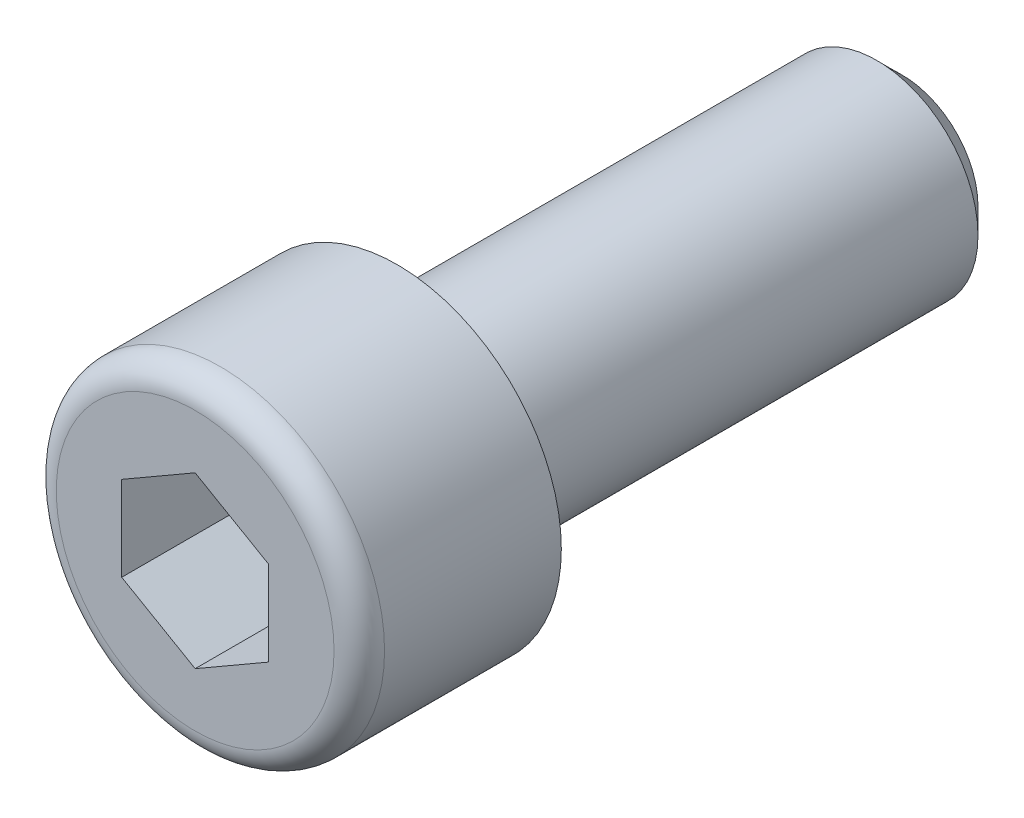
ISO-10303-21;
HEADER;
FILE_DESCRIPTION(('STEP AP214'),'2;1');
FILE_NAME('part.step','',(''),(''),'','','');
FILE_SCHEMA(('AUTOMOTIVE_DESIGN { 1 0 10303 214 1 1 1 1 }'));
ENDSEC;
DATA;
#1=APPLICATION_CONTEXT('core data for automotive mechanical design processes');
#2=APPLICATION_PROTOCOL_DEFINITION('international standard','automotive_design',2000,#1);
#3=PRODUCT_CONTEXT('',#1,'mechanical');
#4=PRODUCT('Part','Part','',(#3));
#5=PRODUCT_RELATED_PRODUCT_CATEGORY('part','',(#4));
#6=PRODUCT_DEFINITION_FORMATION('','',#4);
#7=PRODUCT_DEFINITION_CONTEXT('part definition',#1,'design');
#8=PRODUCT_DEFINITION('design','',#6,#7);
#9=PRODUCT_DEFINITION_SHAPE('','',#8);
#10=(LENGTH_UNIT() NAMED_UNIT(*) SI_UNIT(.MILLI.,.METRE.));
#11=(NAMED_UNIT(*) PLANE_ANGLE_UNIT() SI_UNIT($,.RADIAN.));
#12=(NAMED_UNIT(*) SI_UNIT($,.STERADIAN.) SOLID_ANGLE_UNIT());
#13=UNCERTAINTY_MEASURE_WITH_UNIT(LENGTH_MEASURE(1.E-05),#10,'distance_accuracy_value','');
#14=(GEOMETRIC_REPRESENTATION_CONTEXT(3) GLOBAL_UNCERTAINTY_ASSIGNED_CONTEXT((#13)) GLOBAL_UNIT_ASSIGNED_CONTEXT((#10,
#11,#12)) REPRESENTATION_CONTEXT('',''));
#15=CARTESIAN_POINT('',(0.,0.,0.));
#16=DIRECTION('',(0.,0.,1.));
#17=DIRECTION('',(1.,0.,0.));
#18=AXIS2_PLACEMENT_3D('',#15,#16,#17);
#19=CARTESIAN_POINT('',(-326.297546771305,9.99999999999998,-20.));
#20=DIRECTION('',(0.,0.,1.));
#21=DIRECTION('',(1.,0.,0.));
#22=AXIS2_PLACEMENT_3D('',#19,#20,#21);
#23=CYLINDRICAL_SURFACE('',#22,3.99999999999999);
#24=CARTESIAN_POINT('',(-326.297546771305,9.99999999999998,-19.));
#25=DIRECTION('',(0.,0.,1.));
#26=DIRECTION('',(1.,0.,0.));
#27=AXIS2_PLACEMENT_3D('',#24,#25,#26);
#28=CIRCLE('',#27,3.99999999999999);
#29=CARTESIAN_POINT('',(-322.297546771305,9.99999999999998,-19.));
#30=VERTEX_POINT('',#29);
#31=EDGE_CURVE('E42',#30,#30,#28,.T.);
#32=ORIENTED_EDGE('',*,*,#31,.T.);
#33=EDGE_LOOP('',(#32));
#34=FACE_BOUND('',#33,.T.);
#35=CARTESIAN_POINT('',(-326.297546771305,9.99999999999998,0.));
#36=DIRECTION('',(0.,0.,1.));
#37=DIRECTION('',(1.,0.,0.));
#38=AXIS2_PLACEMENT_3D('',#35,#36,#37);
#39=CIRCLE('',#38,3.99999999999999);
#40=CARTESIAN_POINT('',(-322.297546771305,9.99999999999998,0.));
#41=VERTEX_POINT('',#40);
#42=EDGE_CURVE('E144',#41,#41,#39,.T.);
#43=ORIENTED_EDGE('',*,*,#42,.F.);
#44=EDGE_LOOP('',(#43));
#45=FACE_BOUND('',#44,.T.);
#46=ADVANCED_FACE('F34',(#34,#45),#23,.T.);
#47=CARTESIAN_POINT('',(-326.297546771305,9.99999999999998,-20.));
#48=DIRECTION('',(0.,0.,1.));
#49=DIRECTION('',(1.,0.,0.));
#50=AXIS2_PLACEMENT_3D('',#47,#48,#49);
#51=PLANE('',#50);
#52=CARTESIAN_POINT('',(-326.297546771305,9.99999999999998,-20.));
#53=DIRECTION('',(0.,0.,1.));
#54=DIRECTION('',(1.,0.,0.));
#55=AXIS2_PLACEMENT_3D('',#52,#53,#54);
#56=CIRCLE('',#55,3.);
#57=CARTESIAN_POINT('',(-323.297546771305,9.99999999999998,-20.));
#58=VERTEX_POINT('',#57);
#59=EDGE_CURVE('E11',#58,#58,#56,.F.);
#60=ORIENTED_EDGE('',*,*,#59,.T.);
#61=EDGE_LOOP('',(#60));
#62=FACE_BOUND('',#61,.T.);
#63=ADVANCED_FACE('F171',(#62),#51,.F.);
#64=CARTESIAN_POINT('',(-326.297546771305,9.99999999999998,8.));
#65=DIRECTION('',(0.,0.,-1.));
#66=DIRECTION('',(-1.,0.,0.));
#67=AXIS2_PLACEMENT_3D('',#64,#65,#66);
#68=CYLINDRICAL_SURFACE('',#67,6.50000000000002);
#69=CARTESIAN_POINT('',(-326.297546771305,9.99999999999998,7.));
#70=DIRECTION('',(0.,0.,1.));
#71=DIRECTION('',(1.,0.,0.));
#72=AXIS2_PLACEMENT_3D('',#69,#70,#71);
#73=CIRCLE('',#72,6.50000000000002);
#74=CARTESIAN_POINT('',(-319.797546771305,9.99999999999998,7.));
#75=VERTEX_POINT('',#74);
#76=EDGE_CURVE('E150',#75,#75,#73,.F.);
#77=ORIENTED_EDGE('',*,*,#76,.T.);
#78=EDGE_LOOP('',(#77));
#79=FACE_BOUND('',#78,.T.);
#80=CARTESIAN_POINT('',(-326.297546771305,9.99999999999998,0.));
#81=DIRECTION('',(0.,0.,1.));
#82=DIRECTION('',(1.,0.,0.));
#83=AXIS2_PLACEMENT_3D('',#80,#81,#82);
#84=CIRCLE('',#83,6.50000000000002);
#85=CARTESIAN_POINT('',(-319.797546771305,9.99999999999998,0.));
#86=VERTEX_POINT('',#85);
#87=EDGE_CURVE('E136',#86,#86,#84,.T.);
#88=ORIENTED_EDGE('',*,*,#87,.T.);
#89=EDGE_LOOP('',(#88));
#90=FACE_BOUND('',#89,.T.);
#91=ADVANCED_FACE('F176',(#79,#90),#68,.T.);
#92=CARTESIAN_POINT('',(-326.297546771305,9.99999999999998,8.));
#93=DIRECTION('',(0.,0.,1.));
#94=DIRECTION('',(1.,0.,0.));
#95=AXIS2_PLACEMENT_3D('',#92,#93,#94);
#96=PLANE('',#95);
#97=DIRECTION('',(-0.866025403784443,0.499999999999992,0.));
#98=VECTOR('',#97,1.);
#99=CARTESIAN_POINT('',(-323.389295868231,11.6790794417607,8.));
#100=LINE('',#99,#98);
#101=CARTESIAN_POINT('',(-323.389295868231,11.6790794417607,8.));
#102=VERTEX_POINT('',#101);
#103=CARTESIAN_POINT('',(-326.297546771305,13.3581588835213,8.));
#104=VERTEX_POINT('',#103);
#105=EDGE_CURVE('E49',#102,#104,#100,.T.);
#106=ORIENTED_EDGE('',*,*,#105,.F.);
#107=DIRECTION('',(0.,1.,0.));
#108=VECTOR('',#107,1.);
#109=CARTESIAN_POINT('',(-323.389295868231,8.32092055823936,8.));
#110=LINE('',#109,#108);
#111=CARTESIAN_POINT('',(-323.389295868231,8.32092055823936,8.));
#112=VERTEX_POINT('',#111);
#113=EDGE_CURVE('E132',#112,#102,#110,.T.);
#114=ORIENTED_EDGE('',*,*,#113,.F.);
#115=DIRECTION('',(0.866025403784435,0.500000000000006,0.));
#116=VECTOR('',#115,1.);
#117=CARTESIAN_POINT('',(-326.297546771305,6.64184111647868,8.));
#118=LINE('',#117,#116);
#119=CARTESIAN_POINT('',(-326.297546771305,6.64184111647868,8.));
#120=VERTEX_POINT('',#119);
#121=EDGE_CURVE('E130',#120,#112,#118,.T.);
#122=ORIENTED_EDGE('',*,*,#121,.F.);
#123=DIRECTION('',(0.86602540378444,-0.499999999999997,0.));
#124=VECTOR('',#123,1.);
#125=CARTESIAN_POINT('',(-329.205797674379,8.32092055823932,8.));
#126=LINE('',#125,#124);
#127=CARTESIAN_POINT('',(-329.205797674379,8.32092055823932,8.));
#128=VERTEX_POINT('',#127);
#129=EDGE_CURVE('E97',#128,#120,#126,.T.);
#130=ORIENTED_EDGE('',*,*,#129,.F.);
#131=DIRECTION('',(0.,-1.,0.));
#132=VECTOR('',#131,1.);
#133=CARTESIAN_POINT('',(-329.205797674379,11.6790794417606,8.));
#134=LINE('',#133,#132);
#135=CARTESIAN_POINT('',(-329.205797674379,11.6790794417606,8.));
#136=VERTEX_POINT('',#135);
#137=EDGE_CURVE('E126',#136,#128,#134,.T.);
#138=ORIENTED_EDGE('',*,*,#137,.F.);
#139=DIRECTION('',(-0.866025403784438,-0.500000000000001,0.));
#140=VECTOR('',#139,1.);
#141=CARTESIAN_POINT('',(-326.297546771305,13.3581588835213,8.));
#142=LINE('',#141,#140);
#143=EDGE_CURVE('E123',#104,#136,#142,.T.);
#144=ORIENTED_EDGE('',*,*,#143,.F.);
#145=EDGE_LOOP('',(#106,#114,#122,#130,#138,#144));
#146=FACE_BOUND('',#145,.T.);
#147=CARTESIAN_POINT('',(-326.297546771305,9.99999999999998,8.));
#148=DIRECTION('',(0.,0.,1.));
#149=DIRECTION('',(1.,0.,0.));
#150=AXIS2_PLACEMENT_3D('',#147,#148,#149);
#151=CIRCLE('',#150,5.50000000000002);
#152=CARTESIAN_POINT('',(-320.797546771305,9.99999999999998,8.));
#153=VERTEX_POINT('',#152);
#154=EDGE_CURVE('E147',#153,#153,#151,.T.);
#155=ORIENTED_EDGE('',*,*,#154,.T.);
#156=EDGE_LOOP('',(#155));
#157=FACE_BOUND('',#156,.T.);
#158=ADVANCED_FACE('F182',(#146,#157),#96,.T.);
#159=CARTESIAN_POINT('',(-326.297546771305,9.99999999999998,0.));
#160=DIRECTION('',(0.,0.,1.));
#161=DIRECTION('',(1.,0.,0.));
#162=AXIS2_PLACEMENT_3D('',#159,#160,#161);
#163=PLANE('',#162);
#164=ORIENTED_EDGE('',*,*,#42,.T.);
#165=EDGE_LOOP('',(#164));
#166=FACE_BOUND('',#165,.T.);
#167=ORIENTED_EDGE('',*,*,#87,.F.);
#168=EDGE_LOOP('',(#167));
#169=FACE_BOUND('',#168,.T.);
#170=ADVANCED_FACE('F167',(#166,#169),#163,.F.);
#171=CARTESIAN_POINT('',(-326.297546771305,9.99999999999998,7.));
#172=DIRECTION('',(0.,0.,1.));
#173=DIRECTION('',(1.,0.,0.));
#174=AXIS2_PLACEMENT_3D('',#171,#172,#173);
#175=TOROIDAL_SURFACE('',#174,5.50000000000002,1.);
#176=ORIENTED_EDGE('',*,*,#76,.F.);
#177=EDGE_LOOP('',(#176));
#178=FACE_BOUND('',#177,.T.);
#179=ORIENTED_EDGE('',*,*,#154,.F.);
#180=EDGE_LOOP('',(#179));
#181=FACE_BOUND('',#180,.T.);
#182=ADVANCED_FACE('F159',(#178,#181),#175,.T.);
#183=CARTESIAN_POINT('',(-326.297546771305,9.99999999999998,-19.));
#184=DIRECTION('',(0.,0.,1.));
#185=DIRECTION('',(1.,0.,0.));
#186=AXIS2_PLACEMENT_3D('',#183,#184,#185);
#187=CONICAL_SURFACE('',#186,3.99999999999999,0.785398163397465);
#188=ORIENTED_EDGE('',*,*,#59,.F.);
#189=EDGE_LOOP('',(#188));
#190=FACE_BOUND('',#189,.T.);
#191=ORIENTED_EDGE('',*,*,#31,.F.);
#192=EDGE_LOOP('',(#191));
#193=FACE_BOUND('',#192,.T.);
#194=ADVANCED_FACE('F36',(#190,#193),#187,.T.);
#195=CARTESIAN_POINT('',(-323.389295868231,11.6790794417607,3.));
#196=DIRECTION('',(0.499999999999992,0.866025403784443,0.));
#197=DIRECTION('',(-0.866025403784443,0.499999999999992,0.));
#198=AXIS2_PLACEMENT_3D('',#195,#196,#197);
#199=PLANE('',#198);
#200=ORIENTED_EDGE('',*,*,#105,.T.);
#201=DIRECTION('',(0.,0.,1.));
#202=VECTOR('',#201,1.);
#203=CARTESIAN_POINT('',(-326.297546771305,13.3581588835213,3.));
#204=LINE('',#203,#202);
#205=CARTESIAN_POINT('',(-326.297546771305,13.3581588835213,3.));
#206=VERTEX_POINT('',#205);
#207=EDGE_CURVE('E79',#206,#104,#204,.T.);
#208=ORIENTED_EDGE('',*,*,#207,.F.);
#209=DIRECTION('',(-0.866025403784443,0.499999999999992,0.));
#210=VECTOR('',#209,1.);
#211=CARTESIAN_POINT('',(-323.389295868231,11.6790794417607,3.));
#212=LINE('',#211,#210);
#213=CARTESIAN_POINT('',(-323.389295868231,11.6790794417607,3.));
#214=VERTEX_POINT('',#213);
#215=EDGE_CURVE('E134',#214,#206,#212,.T.);
#216=ORIENTED_EDGE('',*,*,#215,.F.);
#217=DIRECTION('',(0.,0.,1.));
#218=VECTOR('',#217,1.);
#219=CARTESIAN_POINT('',(-323.389295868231,11.6790794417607,3.));
#220=LINE('',#219,#218);
#221=EDGE_CURVE('E57',#214,#102,#220,.T.);
#222=ORIENTED_EDGE('',*,*,#221,.T.);
#223=EDGE_LOOP('',(#200,#208,#216,#222));
#224=FACE_BOUND('',#223,.T.);
#225=ADVANCED_FACE('F158',(#224),#199,.F.);
#226=CARTESIAN_POINT('',(-323.389295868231,8.32092055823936,3.));
#227=DIRECTION('',(1.,0.,0.));
#228=DIRECTION('',(0.,0.,-1.));
#229=AXIS2_PLACEMENT_3D('',#226,#227,#228);
#230=PLANE('',#229);
#231=ORIENTED_EDGE('',*,*,#113,.T.);
#232=ORIENTED_EDGE('',*,*,#221,.F.);
#233=DIRECTION('',(0.,1.,0.));
#234=VECTOR('',#233,1.);
#235=CARTESIAN_POINT('',(-323.389295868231,8.32092055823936,3.));
#236=LINE('',#235,#234);
#237=CARTESIAN_POINT('',(-323.389295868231,8.32092055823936,3.));
#238=VERTEX_POINT('',#237);
#239=EDGE_CURVE('E109',#238,#214,#236,.T.);
#240=ORIENTED_EDGE('',*,*,#239,.F.);
#241=DIRECTION('',(0.,0.,1.));
#242=VECTOR('',#241,1.);
#243=CARTESIAN_POINT('',(-323.389295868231,8.32092055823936,3.));
#244=LINE('',#243,#242);
#245=EDGE_CURVE('E101',#238,#112,#244,.T.);
#246=ORIENTED_EDGE('',*,*,#245,.T.);
#247=EDGE_LOOP('',(#231,#232,#240,#246));
#248=FACE_BOUND('',#247,.T.);
#249=ADVANCED_FACE('F165',(#248),#230,.F.);
#250=CARTESIAN_POINT('',(-326.297546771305,6.64184111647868,3.));
#251=DIRECTION('',(0.500000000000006,-0.866025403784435,0.));
#252=DIRECTION('',(0.866025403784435,0.500000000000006,0.));
#253=AXIS2_PLACEMENT_3D('',#250,#251,#252);
#254=PLANE('',#253);
#255=ORIENTED_EDGE('',*,*,#121,.T.);
#256=ORIENTED_EDGE('',*,*,#245,.F.);
#257=DIRECTION('',(0.866025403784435,0.500000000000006,0.));
#258=VECTOR('',#257,1.);
#259=CARTESIAN_POINT('',(-326.297546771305,6.64184111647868,3.));
#260=LINE('',#259,#258);
#261=CARTESIAN_POINT('',(-326.297546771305,6.64184111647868,3.));
#262=VERTEX_POINT('',#261);
#263=EDGE_CURVE('E105',#262,#238,#260,.T.);
#264=ORIENTED_EDGE('',*,*,#263,.F.);
#265=DIRECTION('',(0.,0.,1.));
#266=VECTOR('',#265,1.);
#267=CARTESIAN_POINT('',(-326.297546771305,6.64184111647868,3.));
#268=LINE('',#267,#266);
#269=EDGE_CURVE('E90',#262,#120,#268,.T.);
#270=ORIENTED_EDGE('',*,*,#269,.T.);
#271=EDGE_LOOP('',(#255,#256,#264,#270));
#272=FACE_BOUND('',#271,.T.);
#273=ADVANCED_FACE('F106',(#272),#254,.F.);
#274=CARTESIAN_POINT('',(-329.205797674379,8.32092055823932,3.));
#275=DIRECTION('',(-0.499999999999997,-0.86602540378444,0.));
#276=DIRECTION('',(0.86602540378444,-0.499999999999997,0.));
#277=AXIS2_PLACEMENT_3D('',#274,#275,#276);
#278=PLANE('',#277);
#279=ORIENTED_EDGE('',*,*,#129,.T.);
#280=ORIENTED_EDGE('',*,*,#269,.F.);
#281=DIRECTION('',(0.86602540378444,-0.499999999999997,0.));
#282=VECTOR('',#281,1.);
#283=CARTESIAN_POINT('',(-329.205797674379,8.32092055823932,3.));
#284=LINE('',#283,#282);
#285=CARTESIAN_POINT('',(-329.205797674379,8.32092055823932,3.));
#286=VERTEX_POINT('',#285);
#287=EDGE_CURVE('E94',#286,#262,#284,.T.);
#288=ORIENTED_EDGE('',*,*,#287,.F.);
#289=DIRECTION('',(0.,0.,1.));
#290=VECTOR('',#289,1.);
#291=CARTESIAN_POINT('',(-329.205797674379,8.32092055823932,3.));
#292=LINE('',#291,#290);
#293=EDGE_CURVE('E102',#286,#128,#292,.T.);
#294=ORIENTED_EDGE('',*,*,#293,.T.);
#295=EDGE_LOOP('',(#279,#280,#288,#294));
#296=FACE_BOUND('',#295,.T.);
#297=ADVANCED_FACE('F92',(#296),#278,.F.);
#298=CARTESIAN_POINT('',(-329.205797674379,11.6790794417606,3.));
#299=DIRECTION('',(-1.,0.,0.));
#300=DIRECTION('',(0.,0.,1.));
#301=AXIS2_PLACEMENT_3D('',#298,#299,#300);
#302=PLANE('',#301);
#303=ORIENTED_EDGE('',*,*,#137,.T.);
#304=ORIENTED_EDGE('',*,*,#293,.F.);
#305=DIRECTION('',(0.,-1.,0.));
#306=VECTOR('',#305,1.);
#307=CARTESIAN_POINT('',(-329.205797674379,11.6790794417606,3.));
#308=LINE('',#307,#306);
#309=CARTESIAN_POINT('',(-329.205797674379,11.6790794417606,3.));
#310=VERTEX_POINT('',#309);
#311=EDGE_CURVE('E115',#310,#286,#308,.T.);
#312=ORIENTED_EDGE('',*,*,#311,.F.);
#313=DIRECTION('',(0.,0.,1.));
#314=VECTOR('',#313,1.);
#315=CARTESIAN_POINT('',(-329.205797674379,11.6790794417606,3.));
#316=LINE('',#315,#314);
#317=EDGE_CURVE('E139',#310,#136,#316,.T.);
#318=ORIENTED_EDGE('',*,*,#317,.T.);
#319=EDGE_LOOP('',(#303,#304,#312,#318));
#320=FACE_BOUND('',#319,.T.);
#321=ADVANCED_FACE('F193',(#320),#302,.F.);
#322=CARTESIAN_POINT('',(-326.297546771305,13.3581588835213,3.));
#323=DIRECTION('',(-0.500000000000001,0.866025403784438,0.));
#324=DIRECTION('',(-0.866025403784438,-0.500000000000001,0.));
#325=AXIS2_PLACEMENT_3D('',#322,#323,#324);
#326=PLANE('',#325);
#327=ORIENTED_EDGE('',*,*,#143,.T.);
#328=ORIENTED_EDGE('',*,*,#317,.F.);
#329=DIRECTION('',(-0.866025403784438,-0.500000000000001,0.));
#330=VECTOR('',#329,1.);
#331=CARTESIAN_POINT('',(-326.297546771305,13.3581588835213,3.));
#332=LINE('',#331,#330);
#333=EDGE_CURVE('E117',#206,#310,#332,.T.);
#334=ORIENTED_EDGE('',*,*,#333,.F.);
#335=ORIENTED_EDGE('',*,*,#207,.T.);
#336=EDGE_LOOP('',(#327,#328,#334,#335));
#337=FACE_BOUND('',#336,.T.);
#338=ADVANCED_FACE('F190',(#337),#326,.F.);
#339=CARTESIAN_POINT('',(-326.297546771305,13.3581588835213,3.));
#340=DIRECTION('',(0.,0.,1.));
#341=DIRECTION('',(1.,0.,0.));
#342=AXIS2_PLACEMENT_3D('',#339,#340,#341);
#343=PLANE('',#342);
#344=ORIENTED_EDGE('',*,*,#215,.T.);
#345=ORIENTED_EDGE('',*,*,#333,.T.);
#346=ORIENTED_EDGE('',*,*,#311,.T.);
#347=ORIENTED_EDGE('',*,*,#287,.T.);
#348=ORIENTED_EDGE('',*,*,#263,.T.);
#349=ORIENTED_EDGE('',*,*,#239,.T.);
#350=EDGE_LOOP('',(#344,#345,#346,#347,#348,#349));
#351=FACE_BOUND('',#350,.T.);
#352=ADVANCED_FACE('F112',(#351),#343,.T.);
#353=CLOSED_SHELL('',(#46,#63,#91,#158,#170,#182,#194,#225,#249,#273,#297,#321,#338,#352));
#354=MANIFOLD_SOLID_BREP('B2',#353);
#355=ADVANCED_BREP_SHAPE_REPRESENTATION('',(#18,#354),#14);
#356=SHAPE_DEFINITION_REPRESENTATION(#9,#355);
ENDSEC;
END-ISO-10303-21;
